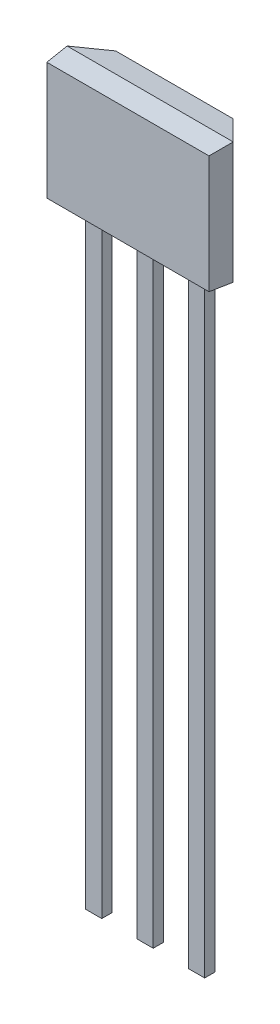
from build123d import *

# Parameters (mm, degrees)
SKETCH_1_W             = 4.1
SKETCH_1_H             = 3
EXTRUDE_1_DEPTH        = 1.15
CUT_EXTRUDE_1_DEPTH    = 4.8111678
CUT_EXTRUDE_2_DEPTH    = 5.926966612
EXTRUDE_2_DEPTH        = 0.125
EXTRUDE_2_DEPTH_BACK   = 0.125
SKETCH_5_W             = 0.4
SKETCH_5_H             = 15.2
EXTRUDE_2_2_DEPTH      = 0.125
EXTRUDE_2_2_DEPTH_BACK = 0.125
EXTRUDE_2_3_DEPTH      = 0.125
EXTRUDE_2_3_DEPTH_BACK = 0.125
SKETCH_7_R             = 0.15
EXTRUDE_3_DEPTH        = 0.1


with BuildPart() as part:
    # Sketch 1 → Extrude 1 (new body)
    with BuildSketch(Plane.XY):
        Rectangle(SKETCH_1_W, SKETCH_1_H)
    extrude(amount=EXTRUDE_1_DEPTH)

    # Sketch 2 → Cut-Extrude 1 (cut, through all)
    with BuildSketch(Plane.XZ.offset(1.5)):
        Polygon((-1.45, 0), (-2.05, 0.6), (-2.05, 0), align=None)
        Polygon((2.05, 0.6), (1.45, 0), (2.05, 0), align=None)
        Polygon((-2.05, 0.6), (-2.001881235, 1.15), (-2.05, 1.15), align=None)
        Polygon((2.05, 0.6), (2.001881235, 1.15), (2.05, 1.15), align=None)
    extrude(amount=-CUT_EXTRUDE_1_DEPTH, mode=Mode.SUBTRACT)

    # Sketch 3 → Cut-Extrude 2 (cut, through all)
    with BuildSketch(Plane(origin=(2.5, 0, 0), x_dir=(0, 0, -1), z_dir=(1, 0, 0))):
        Polygon((0, -1.5), (-0.6, -1.5), (0, -1.394203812), align=None)
        Polygon((-0.6, -1.5), (-1.15, -1.451881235), (-1.15, -1.5), align=None)
        Polygon((-0.6, 1.5), (-1.15, 1.451881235), (-1.15, 1.5), align=None)
        Polygon((-0.6, 1.5), (0, 1.394203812), (0, 1.5), align=None)
    extrude(amount=-CUT_EXTRUDE_2_DEPTH, mode=Mode.SUBTRACT)


with BuildPart() as body_2:
    # Sketch 5 → Extrude 2 (new, two sides: drawn at the far end of the back side and taken through both)
    with BuildSketch(Plane.XY.offset(0.6).offset(-EXTRUDE_2_DEPTH_BACK)):
        with Locations((-1.27, -9)):
            Rectangle(SKETCH_5_W, SKETCH_5_H)
    extrude(amount=EXTRUDE_2_DEPTH + EXTRUDE_2_DEPTH_BACK)


with BuildPart() as body_3:
    # Sketch 5 → Extrude 2 2 (new, two sides: drawn at the far end of the back side and taken through both)
    with BuildSketch(Plane.XY.offset(0.6).offset(-EXTRUDE_2_2_DEPTH_BACK)):
        with Locations((0, -9)):
            Rectangle(SKETCH_5_W, SKETCH_5_H)
    extrude(amount=EXTRUDE_2_2_DEPTH + EXTRUDE_2_2_DEPTH_BACK)


with BuildPart() as body_4:
    # Sketch 5 → Extrude 2 3 (new, two sides: drawn at the far end of the back side and taken through both)
    with BuildSketch(Plane.XY.offset(0.6).offset(-EXTRUDE_2_3_DEPTH_BACK)):
        with Locations((1.27, -9)):
            Rectangle(SKETCH_5_W, SKETCH_5_H)
    extrude(amount=EXTRUDE_2_3_DEPTH + EXTRUDE_2_3_DEPTH_BACK)


with BuildPart() as body_5:
    # Sketch 7 → Extrude 3 (new body)
    with BuildSketch(Plane.XY.offset(0.41)):
        with Locations((0, 0.79)):
            Circle(SKETCH_7_R)
    extrude(amount=EXTRUDE_3_DEPTH)


solid = Compound([part.part, body_2.part, body_3.part, body_4.part, body_5.part])
